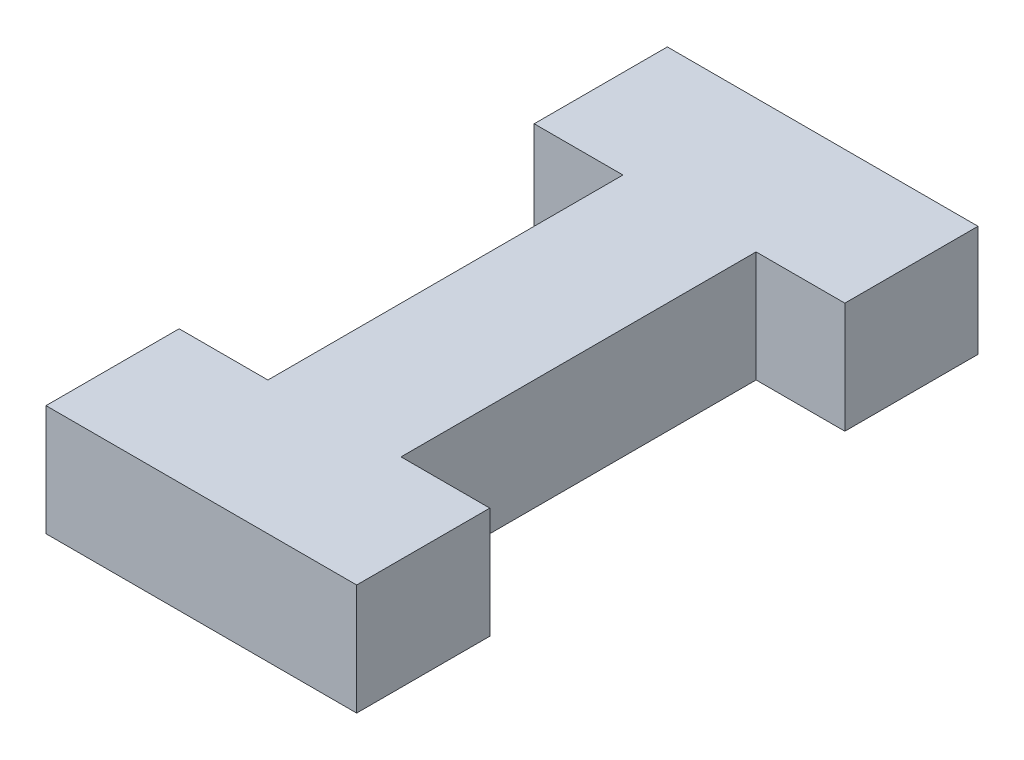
ISO-10303-21;
HEADER;
FILE_DESCRIPTION(('STEP AP214'),'2;1');
FILE_NAME('part.step','',(''),(''),'','','');
FILE_SCHEMA(('AUTOMOTIVE_DESIGN { 1 0 10303 214 1 1 1 1 }'));
ENDSEC;
DATA;
#1=APPLICATION_CONTEXT('core data for automotive mechanical design processes');
#2=APPLICATION_PROTOCOL_DEFINITION('international standard','automotive_design',2000,#1);
#3=PRODUCT_CONTEXT('',#1,'mechanical');
#4=PRODUCT('Part','Part','',(#3));
#5=PRODUCT_RELATED_PRODUCT_CATEGORY('part','',(#4));
#6=PRODUCT_DEFINITION_FORMATION('','',#4);
#7=PRODUCT_DEFINITION_CONTEXT('part definition',#1,'design');
#8=PRODUCT_DEFINITION('design','',#6,#7);
#9=PRODUCT_DEFINITION_SHAPE('','',#8);
#10=(LENGTH_UNIT() NAMED_UNIT(*) SI_UNIT(.MILLI.,.METRE.));
#11=(NAMED_UNIT(*) PLANE_ANGLE_UNIT() SI_UNIT($,.RADIAN.));
#12=(NAMED_UNIT(*) SI_UNIT($,.STERADIAN.) SOLID_ANGLE_UNIT());
#13=UNCERTAINTY_MEASURE_WITH_UNIT(LENGTH_MEASURE(1.E-05),#10,'distance_accuracy_value','');
#14=(GEOMETRIC_REPRESENTATION_CONTEXT(3) GLOBAL_UNCERTAINTY_ASSIGNED_CONTEXT((#13)) GLOBAL_UNIT_ASSIGNED_CONTEXT((#10,
#11,#12)) REPRESENTATION_CONTEXT('',''));
#15=CARTESIAN_POINT('',(0.,0.,0.));
#16=DIRECTION('',(0.,0.,1.));
#17=DIRECTION('',(1.,0.,0.));
#18=AXIS2_PLACEMENT_3D('',#15,#16,#17);
#19=CARTESIAN_POINT('',(-3.5,2.5,-7.));
#20=DIRECTION('',(1.,0.,0.));
#21=DIRECTION('',(0.,0.,-1.));
#22=AXIS2_PLACEMENT_3D('',#19,#20,#21);
#23=PLANE('',#22);
#24=DIRECTION('',(0.,0.,1.));
#25=VECTOR('',#24,1.);
#26=CARTESIAN_POINT('',(-3.5,0.,-7.));
#27=LINE('',#26,#25);
#28=CARTESIAN_POINT('',(-3.5,0.,-7.));
#29=VERTEX_POINT('',#28);
#30=CARTESIAN_POINT('',(-3.5,0.,-4.));
#31=VERTEX_POINT('',#30);
#32=EDGE_CURVE('E152',#29,#31,#27,.T.);
#33=ORIENTED_EDGE('',*,*,#32,.T.);
#34=DIRECTION('',(0.,-1.,0.));
#35=VECTOR('',#34,1.);
#36=CARTESIAN_POINT('',(-3.5,2.5,-4.));
#37=LINE('',#36,#35);
#38=CARTESIAN_POINT('',(-3.5,2.5,-4.));
#39=VERTEX_POINT('',#38);
#40=EDGE_CURVE('E11',#39,#31,#37,.T.);
#41=ORIENTED_EDGE('',*,*,#40,.F.);
#42=DIRECTION('',(0.,0.,1.));
#43=VECTOR('',#42,1.);
#44=CARTESIAN_POINT('',(-3.5,2.5,-7.));
#45=LINE('',#44,#43);
#46=CARTESIAN_POINT('',(-3.5,2.5,-7.));
#47=VERTEX_POINT('',#46);
#48=EDGE_CURVE('E179',#47,#39,#45,.T.);
#49=ORIENTED_EDGE('',*,*,#48,.F.);
#50=DIRECTION('',(0.,-1.,0.));
#51=VECTOR('',#50,1.);
#52=CARTESIAN_POINT('',(-3.5,2.5,-7.));
#53=LINE('',#52,#51);
#54=EDGE_CURVE('E148',#47,#29,#53,.T.);
#55=ORIENTED_EDGE('',*,*,#54,.T.);
#56=EDGE_LOOP('',(#33,#41,#49,#55));
#57=FACE_BOUND('',#56,.T.);
#58=ADVANCED_FACE('F33',(#57),#23,.F.);
#59=CARTESIAN_POINT('',(-3.5,2.5,-4.));
#60=DIRECTION('',(0.,0.,-1.));
#61=DIRECTION('',(-1.,0.,0.));
#62=AXIS2_PLACEMENT_3D('',#59,#60,#61);
#63=PLANE('',#62);
#64=DIRECTION('',(1.,0.,0.));
#65=VECTOR('',#64,1.);
#66=CARTESIAN_POINT('',(-3.5,0.,-4.));
#67=LINE('',#66,#65);
#68=CARTESIAN_POINT('',(-1.5,0.,-4.));
#69=VERTEX_POINT('',#68);
#70=EDGE_CURVE('E155',#31,#69,#67,.T.);
#71=ORIENTED_EDGE('',*,*,#70,.T.);
#72=DIRECTION('',(0.,-1.,0.));
#73=VECTOR('',#72,1.);
#74=CARTESIAN_POINT('',(-1.5,2.5,-4.));
#75=LINE('',#74,#73);
#76=CARTESIAN_POINT('',(-1.5,2.5,-4.));
#77=VERTEX_POINT('',#76);
#78=EDGE_CURVE('E41',#77,#69,#75,.T.);
#79=ORIENTED_EDGE('',*,*,#78,.F.);
#80=DIRECTION('',(1.,0.,0.));
#81=VECTOR('',#80,1.);
#82=CARTESIAN_POINT('',(-3.5,2.5,-4.));
#83=LINE('',#82,#81);
#84=EDGE_CURVE('E100',#39,#77,#83,.T.);
#85=ORIENTED_EDGE('',*,*,#84,.F.);
#86=ORIENTED_EDGE('',*,*,#40,.T.);
#87=EDGE_LOOP('',(#71,#79,#85,#86));
#88=FACE_BOUND('',#87,.T.);
#89=ADVANCED_FACE('F250',(#88),#63,.F.);
#90=CARTESIAN_POINT('',(-1.5,2.5,-4.));
#91=DIRECTION('',(1.,0.,0.));
#92=DIRECTION('',(0.,0.,-1.));
#93=AXIS2_PLACEMENT_3D('',#90,#91,#92);
#94=PLANE('',#93);
#95=DIRECTION('',(0.,0.,1.));
#96=VECTOR('',#95,1.);
#97=CARTESIAN_POINT('',(-1.5,0.,-4.));
#98=LINE('',#97,#96);
#99=CARTESIAN_POINT('',(-1.5,0.,4.));
#100=VERTEX_POINT('',#99);
#101=EDGE_CURVE('E157',#69,#100,#98,.T.);
#102=ORIENTED_EDGE('',*,*,#101,.T.);
#103=DIRECTION('',(0.,-1.,0.));
#104=VECTOR('',#103,1.);
#105=CARTESIAN_POINT('',(-1.5,2.5,4.));
#106=LINE('',#105,#104);
#107=CARTESIAN_POINT('',(-1.5,2.5,4.));
#108=VERTEX_POINT('',#107);
#109=EDGE_CURVE('E195',#108,#100,#106,.T.);
#110=ORIENTED_EDGE('',*,*,#109,.F.);
#111=DIRECTION('',(0.,0.,1.));
#112=VECTOR('',#111,1.);
#113=CARTESIAN_POINT('',(-1.5,2.5,-4.));
#114=LINE('',#113,#112);
#115=EDGE_CURVE('E203',#77,#108,#114,.T.);
#116=ORIENTED_EDGE('',*,*,#115,.F.);
#117=ORIENTED_EDGE('',*,*,#78,.T.);
#118=EDGE_LOOP('',(#102,#110,#116,#117));
#119=FACE_BOUND('',#118,.T.);
#120=ADVANCED_FACE('F201',(#119),#94,.F.);
#121=CARTESIAN_POINT('',(-1.5,2.5,4.));
#122=DIRECTION('',(0.,0.,1.));
#123=DIRECTION('',(1.,0.,0.));
#124=AXIS2_PLACEMENT_3D('',#121,#122,#123);
#125=PLANE('',#124);
#126=DIRECTION('',(-1.,0.,0.));
#127=VECTOR('',#126,1.);
#128=CARTESIAN_POINT('',(-1.5,0.,4.));
#129=LINE('',#128,#127);
#130=CARTESIAN_POINT('',(-3.5,0.,4.));
#131=VERTEX_POINT('',#130);
#132=EDGE_CURVE('E159',#100,#131,#129,.T.);
#133=ORIENTED_EDGE('',*,*,#132,.T.);
#134=DIRECTION('',(0.,-1.,0.));
#135=VECTOR('',#134,1.);
#136=CARTESIAN_POINT('',(-3.5,2.5,4.));
#137=LINE('',#136,#135);
#138=CARTESIAN_POINT('',(-3.5,2.5,4.));
#139=VERTEX_POINT('',#138);
#140=EDGE_CURVE('E192',#139,#131,#137,.T.);
#141=ORIENTED_EDGE('',*,*,#140,.F.);
#142=DIRECTION('',(-1.,0.,0.));
#143=VECTOR('',#142,1.);
#144=CARTESIAN_POINT('',(-1.5,2.5,4.));
#145=LINE('',#144,#143);
#146=EDGE_CURVE('E221',#108,#139,#145,.T.);
#147=ORIENTED_EDGE('',*,*,#146,.F.);
#148=ORIENTED_EDGE('',*,*,#109,.T.);
#149=EDGE_LOOP('',(#133,#141,#147,#148));
#150=FACE_BOUND('',#149,.T.);
#151=ADVANCED_FACE('F212',(#150),#125,.F.);
#152=CARTESIAN_POINT('',(-3.5,2.5,4.));
#153=DIRECTION('',(1.,0.,0.));
#154=DIRECTION('',(0.,0.,-1.));
#155=AXIS2_PLACEMENT_3D('',#152,#153,#154);
#156=PLANE('',#155);
#157=DIRECTION('',(0.,0.,1.));
#158=VECTOR('',#157,1.);
#159=CARTESIAN_POINT('',(-3.5,0.,4.));
#160=LINE('',#159,#158);
#161=CARTESIAN_POINT('',(-3.5,0.,7.));
#162=VERTEX_POINT('',#161);
#163=EDGE_CURVE('E161',#131,#162,#160,.T.);
#164=ORIENTED_EDGE('',*,*,#163,.T.);
#165=DIRECTION('',(0.,-1.,0.));
#166=VECTOR('',#165,1.);
#167=CARTESIAN_POINT('',(-3.5,2.5,7.));
#168=LINE('',#167,#166);
#169=CARTESIAN_POINT('',(-3.5,2.5,7.));
#170=VERTEX_POINT('',#169);
#171=EDGE_CURVE('E189',#170,#162,#168,.T.);
#172=ORIENTED_EDGE('',*,*,#171,.F.);
#173=DIRECTION('',(0.,0.,1.));
#174=VECTOR('',#173,1.);
#175=CARTESIAN_POINT('',(-3.5,2.5,4.));
#176=LINE('',#175,#174);
#177=EDGE_CURVE('E218',#139,#170,#176,.T.);
#178=ORIENTED_EDGE('',*,*,#177,.F.);
#179=ORIENTED_EDGE('',*,*,#140,.T.);
#180=EDGE_LOOP('',(#164,#172,#178,#179));
#181=FACE_BOUND('',#180,.T.);
#182=ADVANCED_FACE('F216',(#181),#156,.F.);
#183=CARTESIAN_POINT('',(-3.5,2.5,7.));
#184=DIRECTION('',(0.,0.,-1.));
#185=DIRECTION('',(-1.,0.,0.));
#186=AXIS2_PLACEMENT_3D('',#183,#184,#185);
#187=PLANE('',#186);
#188=DIRECTION('',(1.,0.,0.));
#189=VECTOR('',#188,1.);
#190=CARTESIAN_POINT('',(-3.5,0.,7.));
#191=LINE('',#190,#189);
#192=CARTESIAN_POINT('',(3.5,0.,7.));
#193=VERTEX_POINT('',#192);
#194=EDGE_CURVE('E163',#162,#193,#191,.T.);
#195=ORIENTED_EDGE('',*,*,#194,.T.);
#196=DIRECTION('',(0.,-1.,0.));
#197=VECTOR('',#196,1.);
#198=CARTESIAN_POINT('',(3.5,2.5,7.));
#199=LINE('',#198,#197);
#200=CARTESIAN_POINT('',(3.5,2.5,7.));
#201=VERTEX_POINT('',#200);
#202=EDGE_CURVE('E187',#201,#193,#199,.T.);
#203=ORIENTED_EDGE('',*,*,#202,.F.);
#204=DIRECTION('',(1.,0.,0.));
#205=VECTOR('',#204,1.);
#206=CARTESIAN_POINT('',(-3.5,2.5,7.));
#207=LINE('',#206,#205);
#208=EDGE_CURVE('E220',#170,#201,#207,.T.);
#209=ORIENTED_EDGE('',*,*,#208,.F.);
#210=ORIENTED_EDGE('',*,*,#171,.T.);
#211=EDGE_LOOP('',(#195,#203,#209,#210));
#212=FACE_BOUND('',#211,.T.);
#213=ADVANCED_FACE('F263',(#212),#187,.F.);
#214=CARTESIAN_POINT('',(3.5,2.5,4.));
#215=DIRECTION('',(1.,0.,0.));
#216=DIRECTION('',(0.,0.,-1.));
#217=AXIS2_PLACEMENT_3D('',#214,#215,#216);
#218=PLANE('',#217);
#219=DIRECTION('',(0.,0.,1.));
#220=VECTOR('',#219,1.);
#221=CARTESIAN_POINT('',(3.5,0.,4.));
#222=LINE('',#221,#220);
#223=CARTESIAN_POINT('',(3.5,0.,4.));
#224=VERTEX_POINT('',#223);
#225=EDGE_CURVE('E166',#224,#193,#222,.T.);
#226=ORIENTED_EDGE('',*,*,#225,.F.);
#227=DIRECTION('',(0.,-1.,0.));
#228=VECTOR('',#227,1.);
#229=CARTESIAN_POINT('',(3.5,2.5,4.));
#230=LINE('',#229,#228);
#231=CARTESIAN_POINT('',(3.5,2.5,4.));
#232=VERTEX_POINT('',#231);
#233=EDGE_CURVE('E185',#232,#224,#230,.T.);
#234=ORIENTED_EDGE('',*,*,#233,.F.);
#235=DIRECTION('',(0.,0.,1.));
#236=VECTOR('',#235,1.);
#237=CARTESIAN_POINT('',(3.5,2.5,4.));
#238=LINE('',#237,#236);
#239=EDGE_CURVE('E223',#232,#201,#238,.T.);
#240=ORIENTED_EDGE('',*,*,#239,.T.);
#241=ORIENTED_EDGE('',*,*,#202,.T.);
#242=EDGE_LOOP('',(#226,#234,#240,#241));
#243=FACE_BOUND('',#242,.T.);
#244=ADVANCED_FACE('F266',(#243),#218,.T.);
#245=CARTESIAN_POINT('',(1.5,2.5,4.));
#246=DIRECTION('',(0.,0.,-1.));
#247=DIRECTION('',(-1.,0.,0.));
#248=AXIS2_PLACEMENT_3D('',#245,#246,#247);
#249=PLANE('',#248);
#250=DIRECTION('',(1.,0.,0.));
#251=VECTOR('',#250,1.);
#252=CARTESIAN_POINT('',(1.5,0.,4.));
#253=LINE('',#252,#251);
#254=CARTESIAN_POINT('',(1.5,0.,4.));
#255=VERTEX_POINT('',#254);
#256=EDGE_CURVE('E169',#255,#224,#253,.T.);
#257=ORIENTED_EDGE('',*,*,#256,.F.);
#258=DIRECTION('',(0.,-1.,0.));
#259=VECTOR('',#258,1.);
#260=CARTESIAN_POINT('',(1.5,2.5,4.));
#261=LINE('',#260,#259);
#262=CARTESIAN_POINT('',(1.5,2.5,4.));
#263=VERTEX_POINT('',#262);
#264=EDGE_CURVE('E183',#263,#255,#261,.T.);
#265=ORIENTED_EDGE('',*,*,#264,.F.);
#266=DIRECTION('',(1.,0.,0.));
#267=VECTOR('',#266,1.);
#268=CARTESIAN_POINT('',(1.5,2.5,4.));
#269=LINE('',#268,#267);
#270=EDGE_CURVE('E230',#263,#232,#269,.T.);
#271=ORIENTED_EDGE('',*,*,#270,.T.);
#272=ORIENTED_EDGE('',*,*,#233,.T.);
#273=EDGE_LOOP('',(#257,#265,#271,#272));
#274=FACE_BOUND('',#273,.T.);
#275=ADVANCED_FACE('F270',(#274),#249,.T.);
#276=CARTESIAN_POINT('',(1.5,2.5,-4.));
#277=DIRECTION('',(1.,0.,0.));
#278=DIRECTION('',(0.,0.,-1.));
#279=AXIS2_PLACEMENT_3D('',#276,#277,#278);
#280=PLANE('',#279);
#281=DIRECTION('',(0.,0.,1.));
#282=VECTOR('',#281,1.);
#283=CARTESIAN_POINT('',(1.5,0.,-4.));
#284=LINE('',#283,#282);
#285=CARTESIAN_POINT('',(1.5,0.,-4.));
#286=VERTEX_POINT('',#285);
#287=EDGE_CURVE('E172',#286,#255,#284,.T.);
#288=ORIENTED_EDGE('',*,*,#287,.F.);
#289=DIRECTION('',(0.,-1.,0.));
#290=VECTOR('',#289,1.);
#291=CARTESIAN_POINT('',(1.5,2.5,-4.));
#292=LINE('',#291,#290);
#293=CARTESIAN_POINT('',(1.5,2.5,-4.));
#294=VERTEX_POINT('',#293);
#295=EDGE_CURVE('E137',#294,#286,#292,.T.);
#296=ORIENTED_EDGE('',*,*,#295,.F.);
#297=DIRECTION('',(0.,0.,1.));
#298=VECTOR('',#297,1.);
#299=CARTESIAN_POINT('',(1.5,2.5,-4.));
#300=LINE('',#299,#298);
#301=EDGE_CURVE('E144',#294,#263,#300,.T.);
#302=ORIENTED_EDGE('',*,*,#301,.T.);
#303=ORIENTED_EDGE('',*,*,#264,.T.);
#304=EDGE_LOOP('',(#288,#296,#302,#303));
#305=FACE_BOUND('',#304,.T.);
#306=ADVANCED_FACE('F234',(#305),#280,.T.);
#307=CARTESIAN_POINT('',(3.5,2.5,-4.));
#308=DIRECTION('',(0.,0.,1.));
#309=DIRECTION('',(1.,0.,0.));
#310=AXIS2_PLACEMENT_3D('',#307,#308,#309);
#311=PLANE('',#310);
#312=DIRECTION('',(-1.,0.,0.));
#313=VECTOR('',#312,1.);
#314=CARTESIAN_POINT('',(3.5,0.,-4.));
#315=LINE('',#314,#313);
#316=CARTESIAN_POINT('',(3.5,0.,-4.));
#317=VERTEX_POINT('',#316);
#318=EDGE_CURVE('E132',#317,#286,#315,.T.);
#319=ORIENTED_EDGE('',*,*,#318,.F.);
#320=DIRECTION('',(0.,-1.,0.));
#321=VECTOR('',#320,1.);
#322=CARTESIAN_POINT('',(3.5,2.5,-4.));
#323=LINE('',#322,#321);
#324=CARTESIAN_POINT('',(3.5,2.5,-4.));
#325=VERTEX_POINT('',#324);
#326=EDGE_CURVE('E127',#325,#317,#323,.T.);
#327=ORIENTED_EDGE('',*,*,#326,.F.);
#328=DIRECTION('',(-1.,0.,0.));
#329=VECTOR('',#328,1.);
#330=CARTESIAN_POINT('',(3.5,2.5,-4.));
#331=LINE('',#330,#329);
#332=EDGE_CURVE('E130',#325,#294,#331,.T.);
#333=ORIENTED_EDGE('',*,*,#332,.T.);
#334=ORIENTED_EDGE('',*,*,#295,.T.);
#335=EDGE_LOOP('',(#319,#327,#333,#334));
#336=FACE_BOUND('',#335,.T.);
#337=ADVANCED_FACE('F129',(#336),#311,.T.);
#338=CARTESIAN_POINT('',(3.5,2.5,-7.));
#339=DIRECTION('',(1.,0.,0.));
#340=DIRECTION('',(0.,0.,-1.));
#341=AXIS2_PLACEMENT_3D('',#338,#339,#340);
#342=PLANE('',#341);
#343=DIRECTION('',(0.,0.,1.));
#344=VECTOR('',#343,1.);
#345=CARTESIAN_POINT('',(3.5,0.,-7.));
#346=LINE('',#345,#344);
#347=CARTESIAN_POINT('',(3.5,0.,-7.));
#348=VERTEX_POINT('',#347);
#349=EDGE_CURVE('E176',#348,#317,#346,.T.);
#350=ORIENTED_EDGE('',*,*,#349,.F.);
#351=DIRECTION('',(0.,-1.,0.));
#352=VECTOR('',#351,1.);
#353=CARTESIAN_POINT('',(3.5,2.5,-7.));
#354=LINE('',#353,#352);
#355=CARTESIAN_POINT('',(3.5,2.5,-7.));
#356=VERTEX_POINT('',#355);
#357=EDGE_CURVE('E89',#356,#348,#354,.T.);
#358=ORIENTED_EDGE('',*,*,#357,.F.);
#359=DIRECTION('',(0.,0.,1.));
#360=VECTOR('',#359,1.);
#361=CARTESIAN_POINT('',(3.5,2.5,-7.));
#362=LINE('',#361,#360);
#363=EDGE_CURVE('E141',#356,#325,#362,.T.);
#364=ORIENTED_EDGE('',*,*,#363,.T.);
#365=ORIENTED_EDGE('',*,*,#326,.T.);
#366=EDGE_LOOP('',(#350,#358,#364,#365));
#367=FACE_BOUND('',#366,.T.);
#368=ADVANCED_FACE('F146',(#367),#342,.T.);
#369=CARTESIAN_POINT('',(3.5,2.5,-7.));
#370=DIRECTION('',(0.,0.,1.));
#371=DIRECTION('',(1.,0.,0.));
#372=AXIS2_PLACEMENT_3D('',#369,#370,#371);
#373=PLANE('',#372);
#374=DIRECTION('',(-1.,0.,0.));
#375=VECTOR('',#374,1.);
#376=CARTESIAN_POINT('',(3.5,0.,-7.));
#377=LINE('',#376,#375);
#378=EDGE_CURVE('E92',#348,#29,#377,.T.);
#379=ORIENTED_EDGE('',*,*,#378,.T.);
#380=ORIENTED_EDGE('',*,*,#54,.F.);
#381=DIRECTION('',(-1.,0.,0.));
#382=VECTOR('',#381,1.);
#383=CARTESIAN_POINT('',(3.5,2.5,-7.));
#384=LINE('',#383,#382);
#385=EDGE_CURVE('E49',#356,#47,#384,.T.);
#386=ORIENTED_EDGE('',*,*,#385,.F.);
#387=ORIENTED_EDGE('',*,*,#357,.T.);
#388=EDGE_LOOP('',(#379,#380,#386,#387));
#389=FACE_BOUND('',#388,.T.);
#390=ADVANCED_FACE('F239',(#389),#373,.F.);
#391=CARTESIAN_POINT('',(0.,2.5,0.));
#392=DIRECTION('',(0.,1.,0.));
#393=DIRECTION('',(0.,0.,1.));
#394=AXIS2_PLACEMENT_3D('',#391,#392,#393);
#395=PLANE('',#394);
#396=ORIENTED_EDGE('',*,*,#48,.T.);
#397=ORIENTED_EDGE('',*,*,#84,.T.);
#398=ORIENTED_EDGE('',*,*,#115,.T.);
#399=ORIENTED_EDGE('',*,*,#146,.T.);
#400=ORIENTED_EDGE('',*,*,#177,.T.);
#401=ORIENTED_EDGE('',*,*,#208,.T.);
#402=ORIENTED_EDGE('',*,*,#239,.F.);
#403=ORIENTED_EDGE('',*,*,#270,.F.);
#404=ORIENTED_EDGE('',*,*,#301,.F.);
#405=ORIENTED_EDGE('',*,*,#332,.F.);
#406=ORIENTED_EDGE('',*,*,#363,.F.);
#407=ORIENTED_EDGE('',*,*,#385,.T.);
#408=EDGE_LOOP('',(#396,#397,#398,#399,#400,#401,#402,#403,#404,#405,#406,#407));
#409=FACE_BOUND('',#408,.T.);
#410=ADVANCED_FACE('F140',(#409),#395,.T.);
#411=CARTESIAN_POINT('',(0.,0.,0.));
#412=DIRECTION('',(0.,1.,0.));
#413=DIRECTION('',(0.,0.,1.));
#414=AXIS2_PLACEMENT_3D('',#411,#412,#413);
#415=PLANE('',#414);
#416=ORIENTED_EDGE('',*,*,#32,.F.);
#417=ORIENTED_EDGE('',*,*,#378,.F.);
#418=ORIENTED_EDGE('',*,*,#349,.T.);
#419=ORIENTED_EDGE('',*,*,#318,.T.);
#420=ORIENTED_EDGE('',*,*,#287,.T.);
#421=ORIENTED_EDGE('',*,*,#256,.T.);
#422=ORIENTED_EDGE('',*,*,#225,.T.);
#423=ORIENTED_EDGE('',*,*,#194,.F.);
#424=ORIENTED_EDGE('',*,*,#163,.F.);
#425=ORIENTED_EDGE('',*,*,#132,.F.);
#426=ORIENTED_EDGE('',*,*,#101,.F.);
#427=ORIENTED_EDGE('',*,*,#70,.F.);
#428=EDGE_LOOP('',(#416,#417,#418,#419,#420,#421,#422,#423,#424,#425,#426,#427));
#429=FACE_BOUND('',#428,.T.);
#430=ADVANCED_FACE('F207',(#429),#415,.F.);
#431=CLOSED_SHELL('',(#58,#89,#120,#151,#182,#213,#244,#275,#306,#337,#368,#390,#410,#430));
#432=MANIFOLD_SOLID_BREP('B2',#431);
#433=ADVANCED_BREP_SHAPE_REPRESENTATION('',(#18,#432),#14);
#434=SHAPE_DEFINITION_REPRESENTATION(#9,#433);
ENDSEC;
END-ISO-10303-21;
